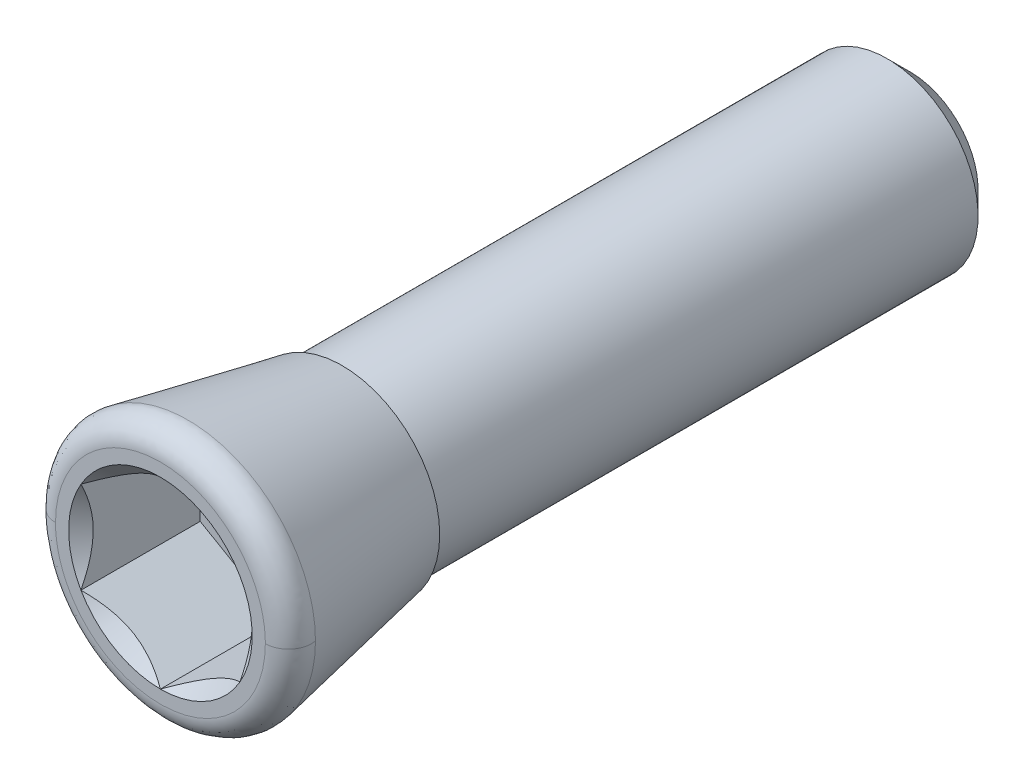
ISO-10303-21;
HEADER;
FILE_DESCRIPTION(('STEP AP214'),'2;1');
FILE_NAME('part.step','',(''),(''),'','','');
FILE_SCHEMA(('AUTOMOTIVE_DESIGN { 1 0 10303 214 1 1 1 1 }'));
ENDSEC;
DATA;
#1=APPLICATION_CONTEXT('core data for automotive mechanical design processes');
#2=APPLICATION_PROTOCOL_DEFINITION('international standard','automotive_design',2000,#1);
#3=PRODUCT_CONTEXT('',#1,'mechanical');
#4=PRODUCT('Part','Part','',(#3));
#5=PRODUCT_RELATED_PRODUCT_CATEGORY('part','',(#4));
#6=PRODUCT_DEFINITION_FORMATION('','',#4);
#7=PRODUCT_DEFINITION_CONTEXT('part definition',#1,'design');
#8=PRODUCT_DEFINITION('design','',#6,#7);
#9=PRODUCT_DEFINITION_SHAPE('','',#8);
#10=(LENGTH_UNIT() NAMED_UNIT(*) SI_UNIT(.MILLI.,.METRE.));
#11=(NAMED_UNIT(*) PLANE_ANGLE_UNIT() SI_UNIT($,.RADIAN.));
#12=(NAMED_UNIT(*) SI_UNIT($,.STERADIAN.) SOLID_ANGLE_UNIT());
#13=UNCERTAINTY_MEASURE_WITH_UNIT(LENGTH_MEASURE(1.E-05),#10,'distance_accuracy_value','');
#14=(GEOMETRIC_REPRESENTATION_CONTEXT(3) GLOBAL_UNCERTAINTY_ASSIGNED_CONTEXT((#13)) GLOBAL_UNIT_ASSIGNED_CONTEXT((#10,
#11,#12)) REPRESENTATION_CONTEXT('',''));
#15=CARTESIAN_POINT('',(0.,0.,0.));
#16=DIRECTION('',(0.,0.,1.));
#17=DIRECTION('',(1.,0.,0.));
#18=AXIS2_PLACEMENT_3D('',#15,#16,#17);
#19=CARTESIAN_POINT('',(-6.9999999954,-8.0829037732,-10.5000000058));
#20=DIRECTION('',(0.,0.,1.));
#21=DIRECTION('',(1.,0.,0.));
#22=AXIS2_PLACEMENT_3D('',#19,#20,#21);
#23=PLANE('',#22);
#24=DIRECTION('',(0.866025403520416,0.500000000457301,0.));
#25=VECTOR('',#24,1.);
#26=CARTESIAN_POINT('',(3.4999999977,-6.0621778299,-10.5000000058));
#27=LINE('',#26,#25);
#28=CARTESIAN_POINT('',(0.,-8.0829037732,-10.5000000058));
#29=VERTEX_POINT('',#28);
#30=CARTESIAN_POINT('',(6.9999999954,-4.0414518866,-10.5000000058));
#31=VERTEX_POINT('',#30);
#32=EDGE_CURVE('E105',#29,#31,#27,.T.);
#33=ORIENTED_EDGE('',*,*,#32,.T.);
#34=DIRECTION('',(0.,1.,0.));
#35=VECTOR('',#34,1.);
#36=CARTESIAN_POINT('',(6.9999999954,0.,-10.5000000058));
#37=LINE('',#36,#35);
#38=CARTESIAN_POINT('',(6.9999999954,4.0414518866,-10.5000000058));
#39=VERTEX_POINT('',#38);
#40=EDGE_CURVE('E106',#31,#39,#37,.T.);
#41=ORIENTED_EDGE('',*,*,#40,.T.);
#42=DIRECTION('',(-0.866025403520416,0.500000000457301,0.));
#43=VECTOR('',#42,1.);
#44=CARTESIAN_POINT('',(3.4999999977,6.0621778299,-10.5000000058));
#45=LINE('',#44,#43);
#46=CARTESIAN_POINT('',(0.,8.0829037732,-10.5000000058));
#47=VERTEX_POINT('',#46);
#48=EDGE_CURVE('E104',#39,#47,#45,.T.);
#49=ORIENTED_EDGE('',*,*,#48,.T.);
#50=DIRECTION('',(-0.866025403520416,-0.500000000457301,0.));
#51=VECTOR('',#50,1.);
#52=CARTESIAN_POINT('',(-3.4999999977,6.0621778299,-10.5000000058));
#53=LINE('',#52,#51);
#54=CARTESIAN_POINT('',(-6.9999999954,4.0414518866,-10.5000000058));
#55=VERTEX_POINT('',#54);
#56=EDGE_CURVE('E255',#47,#55,#53,.T.);
#57=ORIENTED_EDGE('',*,*,#56,.T.);
#58=DIRECTION('',(0.,-1.,0.));
#59=VECTOR('',#58,1.);
#60=CARTESIAN_POINT('',(-6.9999999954,0.,-10.5000000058));
#61=LINE('',#60,#59);
#62=CARTESIAN_POINT('',(-6.9999999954,-4.0414518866,-10.5000000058));
#63=VERTEX_POINT('',#62);
#64=EDGE_CURVE('E260',#55,#63,#61,.T.);
#65=ORIENTED_EDGE('',*,*,#64,.T.);
#66=DIRECTION('',(0.866025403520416,-0.500000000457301,0.));
#67=VECTOR('',#66,1.);
#68=CARTESIAN_POINT('',(-3.4999999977,-6.0621778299,-10.5000000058));
#69=LINE('',#68,#67);
#70=EDGE_CURVE('E265',#63,#29,#69,.T.);
#71=ORIENTED_EDGE('',*,*,#70,.T.);
#72=EDGE_LOOP('',(#33,#41,#49,#57,#65,#71));
#73=FACE_BOUND('',#72,.T.);
#74=ADVANCED_FACE('F14',(#73),#23,.T.);
#75=CARTESIAN_POINT('',(0.,8.0829037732,0.0630000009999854));
#76=DIRECTION('',(0.500000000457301,0.866025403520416,0.));
#77=DIRECTION('',(0.866025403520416,-0.500000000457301,0.));
#78=AXIS2_PLACEMENT_3D('',#75,#76,#77);
#79=PLANE('',#78);
#80=CARTESIAN_POINT('',(-1.90424028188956E-10,8.08290377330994,1.09898201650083E-10));
#81=CARTESIAN_POINT('',(0.120353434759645,8.01341768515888,-0.0694756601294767));
#82=CARTESIAN_POINT('',(0.24163193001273,7.94339751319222,-0.136819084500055));
#83=CARTESIAN_POINT('',(0.486220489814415,7.80218424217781,-0.26659289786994));
#84=CARTESIAN_POINT('',(0.609531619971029,7.73099052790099,-0.329020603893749));
#85=CARTESIAN_POINT('',(0.983931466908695,7.51483067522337,-0.508489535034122));
#86=CARTESIAN_POINT('',(1.23818945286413,7.36803475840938,-0.616951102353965));
#87=CARTESIAN_POINT('',(1.75092084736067,7.07200914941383,-0.802683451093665));
#88=CARTESIAN_POINT('',(2.00926323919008,6.92285509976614,-0.880422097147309));
#89=CARTESIAN_POINT('',(2.40102354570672,6.69667218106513,-0.970346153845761));
#90=CARTESIAN_POINT('',(2.53218703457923,6.62094490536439,-0.995861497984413));
#91=CARTESIAN_POINT('',(2.7956244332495,6.46884925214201,-1.03742022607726));
#92=CARTESIAN_POINT('',(2.92789817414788,6.39248097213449,-1.05346502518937));
#93=CARTESIAN_POINT('',(3.25024256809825,6.20637534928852,-1.08036714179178));
#94=CARTESIAN_POINT('',(3.44066055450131,6.09643747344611,-1.08601091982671));
#95=CARTESIAN_POINT('',(3.82115320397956,5.87675993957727,-1.07653288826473));
#96=CARTESIAN_POINT('',(4.01122772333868,5.76702036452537,-1.06140380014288));
#97=CARTESIAN_POINT('',(4.38958463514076,5.5485758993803,-1.01127183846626));
#98=CARTESIAN_POINT('',(4.57786478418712,5.43987230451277,-0.976246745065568));
#99=CARTESIAN_POINT('',(4.95118895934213,5.22433349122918,-0.888226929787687));
#100=CARTESIAN_POINT('',(5.13623323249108,5.11749813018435,-0.835233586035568));
#101=CARTESIAN_POINT('',(5.4646974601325,4.92785921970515,-0.726217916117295));
#102=CARTESIAN_POINT('',(5.60884517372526,4.84463549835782,-0.673064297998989));
#103=CARTESIAN_POINT('',(5.8945533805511,4.67968178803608,-0.558192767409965));
#104=CARTESIAN_POINT('',(6.03611379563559,4.59795184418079,-0.496474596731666));
#105=CARTESIAN_POINT('',(6.31620149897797,4.43624313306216,-0.365857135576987));
#106=CARTESIAN_POINT('',(6.45473675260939,4.35625976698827,-0.296980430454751));
#107=CARTESIAN_POINT('',(6.72924239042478,4.19777386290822,-0.152949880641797));
#108=CARTESIAN_POINT('',(6.86521428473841,4.11927045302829,-0.0777998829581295));
#109=CARTESIAN_POINT('',(7.00000000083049,4.0414518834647,-4.25741386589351E-09));
#110=B_SPLINE_CURVE_WITH_KNOTS('',3,(#80,#81,#82,#83,#84,#85,#86,#87,#88,#89,#90,#91,#92,#93,
#94,#95,#96,#97,#98,#99,#100,#101,#102,#103,#104,#105,#106,#107,#108,#109),.UNSPECIFIED.,.F.,
.F.,(4,2,2,2,2,2,2,2,2,2,2,2,2,2,4),(0.,0.46608558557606,0.93242382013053,1.87013398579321,
2.79295648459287,3.25346289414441,3.71390047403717,4.37271974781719,5.03176992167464,
5.69155757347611,6.35129463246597,6.87523436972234,7.39918990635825,7.92153983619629,
8.44357176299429),.UNSPECIFIED.);
#111=CARTESIAN_POINT('',(-8.28914245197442E-10,8.0829037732,0.));
#112=VERTEX_POINT('',#111);
#113=CARTESIAN_POINT('',(6.99999999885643,4.04145188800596,-3.69630714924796E-09));
#114=VERTEX_POINT('',#113);
#115=EDGE_CURVE('E75',#112,#114,#110,.T.);
#116=ORIENTED_EDGE('',*,*,#115,.F.);
#117=DIRECTION('',(0.,0.,-1.));
#118=VECTOR('',#117,1.);
#119=CARTESIAN_POINT('',(0.,8.0829037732,-5.21850000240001));
#120=LINE('',#119,#118);
#121=EDGE_CURVE('E112',#112,#47,#120,.T.);
#122=ORIENTED_EDGE('',*,*,#121,.T.);
#123=ORIENTED_EDGE('',*,*,#48,.F.);
#124=DIRECTION('',(0.,0.,1.));
#125=VECTOR('',#124,1.);
#126=CARTESIAN_POINT('',(6.9999999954,4.0414518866,-5.21850000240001));
#127=LINE('',#126,#125);
#128=EDGE_CURVE('E85',#39,#114,#127,.T.);
#129=ORIENTED_EDGE('',*,*,#128,.T.);
#130=EDGE_LOOP('',(#116,#122,#123,#129));
#131=FACE_BOUND('',#130,.T.);
#132=ADVANCED_FACE('F103',(#131),#79,.F.);
#133=CARTESIAN_POINT('',(6.9999999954,-4.0414518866,0.0630000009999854));
#134=DIRECTION('',(1.,0.,0.));
#135=DIRECTION('',(0.,0.,-1.));
#136=AXIS2_PLACEMENT_3D('',#133,#134,#135);
#137=PLANE('',#136);
#138=CARTESIAN_POINT('',(6.99999999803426,4.04145189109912,-6.5872168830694E-09));
#139=CARTESIAN_POINT('',(6.99999999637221,3.90338806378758,-0.0690220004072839));
#140=CARTESIAN_POINT('',(6.9999999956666,3.76426930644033,-0.135939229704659));
#141=CARTESIAN_POINT('',(6.99999999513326,3.48371687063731,-0.264929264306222));
#142=CARTESIAN_POINT('',(6.99999999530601,3.34228198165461,-0.326999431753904));
#143=CARTESIAN_POINT('',(6.99999999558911,2.91271256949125,-0.505587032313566));
#144=CARTESIAN_POINT('',(6.99999999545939,2.62096454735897,-0.613637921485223));
#145=CARTESIAN_POINT('',(6.99999999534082,2.02896997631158,-0.800156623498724));
#146=CARTESIAN_POINT('',(6.99999999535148,1.7287559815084,-0.878724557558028));
#147=CARTESIAN_POINT('',(6.9999999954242,1.27353845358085,-0.969551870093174));
#148=CARTESIAN_POINT('',(6.99999999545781,1.12117437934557,-0.995308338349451));
#149=CARTESIAN_POINT('',(6.99999999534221,0.815150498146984,-1.03722804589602));
#150=CARTESIAN_POINT('',(6.99999999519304,0.66149113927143,-1.05339447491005));
#151=CARTESIAN_POINT('',(6.9999999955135,0.423025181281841,-1.07064017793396));
#152=CARTESIAN_POINT('',(6.99999999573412,0.338459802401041,-1.07523577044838));
#153=CARTESIAN_POINT('',(6.99999999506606,0.16926674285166,-1.0813681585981));
#154=CARTESIAN_POINT('',(6.99999999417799,0.0846391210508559,-1.08290661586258));
#155=CARTESIAN_POINT('',(6.99999999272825,-0.212427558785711,-1.08289665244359));
#156=CARTESIAN_POINT('',(6.99999999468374,-0.424927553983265,-1.07318072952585));
#157=CARTESIAN_POINT('',(6.99999999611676,-0.848297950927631,-1.03484950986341));
#158=CARTESIAN_POINT('',(6.99999999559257,-1.05916711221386,-1.00622103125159));
#159=CARTESIAN_POINT('',(6.99999999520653,-1.47874358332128,-0.931410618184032));
#160=CARTESIAN_POINT('',(6.99999999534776,-1.68743634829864,-0.885147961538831));
#161=CARTESIAN_POINT('',(6.99999999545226,-2.10080931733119,-0.777183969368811));
#162=CARTESIAN_POINT('',(6.99999999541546,-2.30548794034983,-0.715476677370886));
#163=CARTESIAN_POINT('',(6.99999999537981,-2.77223551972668,-0.55805548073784));
#164=CARTESIAN_POINT('',(6.99999999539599,-3.03274032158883,-0.457711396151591));
#165=CARTESIAN_POINT('',(6.99999999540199,-3.41656486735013,-0.294472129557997));
#166=CARTESIAN_POINT('',(6.999999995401,-3.54279404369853,-0.238221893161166));
#167=CARTESIAN_POINT('',(6.999999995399,-3.79344553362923,-0.12187747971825));
#168=CARTESIAN_POINT('',(6.99999999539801,-3.91786814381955,-0.0617839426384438));
#169=CARTESIAN_POINT('',(6.9999999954,-4.04145188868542,-6.34990671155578E-09));
#170=B_SPLINE_CURVE_WITH_KNOTS('',3,(#138,#139,#140,#141,#142,#143,#144,#145,#146,#147,#148,
#149,#150,#151,#152,#153,#154,#155,#156,#157,#158,#159,#160,#161,#162,#163,#164,#165,#166,#167,
#168,#169),.UNSPECIFIED.,.F.,.F.,(4,2,2,2,2,2,2,2,2,2,2,2,2,2,2,4),(0.,0.463041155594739,
0.92633257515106,1.85846441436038,2.78740154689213,3.25072702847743,3.71389831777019,
3.9679183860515,4.22180035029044,4.85899417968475,5.49663259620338,6.13722561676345,
6.77806607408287,7.61462829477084,8.02916696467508,8.44363678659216),.UNSPECIFIED.);
#171=CARTESIAN_POINT('',(7.00000000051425,-4.0414518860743,-3.22640525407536E-09));
#172=VERTEX_POINT('',#171);
#173=EDGE_CURVE('E81',#114,#172,#170,.T.);
#174=ORIENTED_EDGE('',*,*,#173,.F.);
#175=ORIENTED_EDGE('',*,*,#128,.F.);
#176=ORIENTED_EDGE('',*,*,#40,.F.);
#177=DIRECTION('',(0.,0.,1.));
#178=VECTOR('',#177,1.);
#179=CARTESIAN_POINT('',(6.9999999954,-4.0414518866,-5.21850000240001));
#180=LINE('',#179,#178);
#181=EDGE_CURVE('E87',#31,#172,#180,.T.);
#182=ORIENTED_EDGE('',*,*,#181,.T.);
#183=EDGE_LOOP('',(#174,#175,#176,#182));
#184=FACE_BOUND('',#183,.T.);
#185=ADVANCED_FACE('F83',(#184),#137,.F.);
#186=CARTESIAN_POINT('',(6.9999999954,-4.0414518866,0.0630000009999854));
#187=DIRECTION('',(0.500000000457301,-0.866025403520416,0.));
#188=DIRECTION('',(-0.866025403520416,-0.500000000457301,0.));
#189=AXIS2_PLACEMENT_3D('',#186,#187,#188);
#190=PLANE('',#189);
#191=CARTESIAN_POINT('',(7.0000000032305,-4.04145188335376,-3.79550557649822E-09));
#192=CARTESIAN_POINT('',(6.87964656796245,-4.11093797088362,-0.0694756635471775));
#193=CARTESIAN_POINT('',(6.75836807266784,-4.18095814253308,-0.136819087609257));
#194=CARTESIAN_POINT('',(6.51377951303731,-4.32217141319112,-0.266592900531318));
#195=CARTESIAN_POINT('',(6.39046838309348,-4.39336512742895,-0.329020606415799));
#196=CARTESIAN_POINT('',(6.01606853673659,-4.60952497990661,-0.508489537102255));
#197=CARTESIAN_POINT('',(5.76181055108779,-4.75632089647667,-0.61695110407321));
#198=CARTESIAN_POINT('',(5.24907915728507,-5.052346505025,-0.802683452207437));
#199=CARTESIAN_POINT('',(4.99073676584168,-5.20150055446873,-0.880422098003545));
#200=CARTESIAN_POINT('',(4.59897645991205,-5.42768347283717,-0.970346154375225));
#201=CARTESIAN_POINT('',(4.46781297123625,-5.5034107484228,-0.995861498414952));
#202=CARTESIAN_POINT('',(4.20437557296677,-5.65550640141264,-1.03742022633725));
#203=CARTESIAN_POINT('',(4.07210183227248,-5.73187468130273,-1.05346502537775));
#204=CARTESIAN_POINT('',(3.74975743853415,-5.9179803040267,-1.08036714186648));
#205=CARTESIAN_POINT('',(3.55933945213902,-6.02791817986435,-1.08601091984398));
#206=CARTESIAN_POINT('',(3.17884680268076,-6.24759571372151,-1.07653288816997));
#207=CARTESIAN_POINT('',(2.9887722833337,-6.35733528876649,-1.06140379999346));
#208=CARTESIAN_POINT('',(2.61041537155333,-6.57577975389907,-1.01127183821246));
#209=CARTESIAN_POINT('',(2.42213522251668,-6.68448334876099,-0.976246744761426));
#210=CARTESIAN_POINT('',(2.04881104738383,-6.90002216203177,-0.88822692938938));
#211=CARTESIAN_POINT('',(1.86376677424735,-7.00685752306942,-0.835233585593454));
#212=CARTESIAN_POINT('',(1.53530254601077,-7.19649643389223,-0.726217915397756));
#213=CARTESIAN_POINT('',(1.39115483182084,-7.27972015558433,-0.673064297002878));
#214=CARTESIAN_POINT('',(1.1054466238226,-7.44467386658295,-0.558192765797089));
#215=CARTESIAN_POINT('',(0.963886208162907,-7.52640381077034,-0.496474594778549));
#216=CARTESIAN_POINT('',(0.683798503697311,-7.68811252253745,-0.36585713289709));
#217=CARTESIAN_POINT('',(0.545263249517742,-7.76809588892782,-0.296980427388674));
#218=CARTESIAN_POINT('',(0.270757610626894,-7.92658179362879,-0.152949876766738));
#219=CARTESIAN_POINT('',(0.13478571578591,-8.00508520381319,-0.0777998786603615));
#220=CARTESIAN_POINT('',(-8.25208548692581E-10,-8.08290377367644,4.76396699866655E-10));
#221=B_SPLINE_CURVE_WITH_KNOTS('',3,(#191,#192,#193,#194,#195,#196,#197,#198,#199,#200,#201,
#202,#203,#204,#205,#206,#207,#208,#209,#210,#211,#212,#213,#214,#215,#216,#217,#218,#219,#220),
.UNSPECIFIED.,.F.,.F.,(4,2,2,2,2,2,2,2,2,2,2,2,2,2,4),(0.,0.466085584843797,0.932423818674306,
1.87013398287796,2.79295648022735,3.25346288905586,3.71390046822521,4.37271974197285,
5.0317699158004,5.691557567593,6.35129462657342,6.87523436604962,7.39918990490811,
7.92153983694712,8.44357176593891),.UNSPECIFIED.);
#222=CARTESIAN_POINT('',(-1.55470505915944E-09,-8.0829037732,0.));
#223=VERTEX_POINT('',#222);
#224=EDGE_CURVE('E91',#172,#223,#221,.T.);
#225=ORIENTED_EDGE('',*,*,#224,.F.);
#226=ORIENTED_EDGE('',*,*,#181,.F.);
#227=ORIENTED_EDGE('',*,*,#32,.F.);
#228=DIRECTION('',(0.,0.,1.));
#229=VECTOR('',#228,1.);
#230=CARTESIAN_POINT('',(0.,-8.0829037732,-5.21850000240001));
#231=LINE('',#230,#229);
#232=EDGE_CURVE('E263',#29,#223,#231,.T.);
#233=ORIENTED_EDGE('',*,*,#232,.T.);
#234=EDGE_LOOP('',(#225,#226,#227,#233));
#235=FACE_BOUND('',#234,.T.);
#236=ADVANCED_FACE('F182',(#235),#190,.F.);
#237=CARTESIAN_POINT('',(0.,-8.0829037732,0.0630000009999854));
#238=DIRECTION('',(-0.500000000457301,-0.866025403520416,0.));
#239=DIRECTION('',(-0.866025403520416,0.500000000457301,0.));
#240=AXIS2_PLACEMENT_3D('',#237,#238,#239);
#241=PLANE('',#240);
#242=CARTESIAN_POINT('',(-8.59793667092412E-10,-8.0829037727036,-4.96408469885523E-10));
#243=CARTESIAN_POINT('',(-0.120353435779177,-8.01341768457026,-0.0694756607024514));
#244=CARTESIAN_POINT('',(-0.241631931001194,-7.94339751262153,-0.136819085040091));
#245=CARTESIAN_POINT('',(-0.486220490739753,-7.80218424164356,-0.266592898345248));
#246=CARTESIAN_POINT('',(-0.609531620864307,-7.73099052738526,-0.32902060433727));
#247=CARTESIAN_POINT('',(-0.983931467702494,-7.51483067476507,-0.508489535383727));
#248=CARTESIAN_POINT('',(-1.23818945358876,-7.36803475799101,-0.616951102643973));
#249=CARTESIAN_POINT('',(-1.75092084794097,-7.0720091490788,-0.802683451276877));
#250=CARTESIAN_POINT('',(-2.00926323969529,-6.92285509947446,-0.880422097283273));
#251=CARTESIAN_POINT('',(-2.40102354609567,-6.69667218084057,-0.970346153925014));
#252=CARTESIAN_POINT('',(-2.532187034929,-6.62094490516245,-0.995861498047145));
#253=CARTESIAN_POINT('',(-2.79562443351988,-6.46884925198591,-1.03742022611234));
#254=CARTESIAN_POINT('',(-2.92789817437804,-6.3924809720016,-1.05346502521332));
#255=CARTESIAN_POINT('',(-3.25024256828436,-6.20637534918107,-1.08036714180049));
#256=CARTESIAN_POINT('',(-3.44066055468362,-6.09643747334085,-1.08601091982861));
#257=CARTESIAN_POINT('',(-3.82115320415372,-5.87675993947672,-1.07653288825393));
#258=CARTESIAN_POINT('',(-4.01122772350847,-5.76702036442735,-1.0614038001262));
#259=CARTESIAN_POINT('',(-4.38958463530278,-5.54857589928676,-1.01127183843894));
#260=CARTESIAN_POINT('',(-4.57786478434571,-5.4398723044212,-0.976246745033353));
#261=CARTESIAN_POINT('',(-4.9511889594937,-5.22433349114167,-0.88822692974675));
#262=CARTESIAN_POINT('',(-5.13623323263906,-5.11749813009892,-0.835233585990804));
#263=CARTESIAN_POINT('',(-5.46469746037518,-4.92785921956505,-0.726217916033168));
#264=CARTESIAN_POINT('',(-5.6088451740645,-4.84463549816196,-0.673064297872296));
#265=CARTESIAN_POINT('',(-5.89455338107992,-4.67968178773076,-0.558192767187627));
#266=CARTESIAN_POINT('',(-6.03611379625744,-4.59795184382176,-0.496474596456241));
#267=CARTESIAN_POINT('',(-6.31620149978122,-4.43624313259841,-0.365857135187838));
#268=CARTESIAN_POINT('',(-6.45473675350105,-4.35625976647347,-0.296980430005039));
#269=CARTESIAN_POINT('',(-6.72924239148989,-4.19777386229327,-0.152949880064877));
#270=CARTESIAN_POINT('',(-6.86521428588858,-4.11927045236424,-0.0777998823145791));
#271=CARTESIAN_POINT('',(-7.00000000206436,-4.04145188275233,-3.54499762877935E-09));
#272=B_SPLINE_CURVE_WITH_KNOTS('',3,(#242,#243,#244,#245,#246,#247,#248,#249,#250,#251,#252,
#253,#254,#255,#256,#257,#258,#259,#260,#261,#262,#263,#264,#265,#266,#267,#268,#269,#270,#271),
.UNSPECIFIED.,.F.,.F.,(4,2,2,2,2,2,2,2,2,2,2,2,2,2,4),(0.,0.466085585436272,0.932423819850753,
1.87013398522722,2.79295648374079,3.25346289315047,3.71390047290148,4.37271974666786,
5.03176992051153,5.69155757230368,6.35129463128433,6.87523436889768,7.39918990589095,
7.92153983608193,8.44357176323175),.UNSPECIFIED.);
#273=CARTESIAN_POINT('',(-7.00000000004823,-4.04145188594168,-3.69630714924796E-09));
#274=VERTEX_POINT('',#273);
#275=EDGE_CURVE('E165',#223,#274,#272,.T.);
#276=ORIENTED_EDGE('',*,*,#275,.F.);
#277=ORIENTED_EDGE('',*,*,#232,.F.);
#278=ORIENTED_EDGE('',*,*,#70,.F.);
#279=DIRECTION('',(0.,0.,1.));
#280=VECTOR('',#279,1.);
#281=CARTESIAN_POINT('',(-6.9999999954,-4.0414518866,-5.21850000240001));
#282=LINE('',#281,#280);
#283=EDGE_CURVE('E258',#63,#274,#282,.T.);
#284=ORIENTED_EDGE('',*,*,#283,.T.);
#285=EDGE_LOOP('',(#276,#277,#278,#284));
#286=FACE_BOUND('',#285,.T.);
#287=ADVANCED_FACE('F178',(#286),#241,.F.);
#288=CARTESIAN_POINT('',(-6.9999999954,-4.0414518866,-10.5000000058));
#289=DIRECTION('',(-1.,0.,0.));
#290=DIRECTION('',(0.,0.,1.));
#291=AXIS2_PLACEMENT_3D('',#288,#289,#290);
#292=PLANE('',#291);
#293=CARTESIAN_POINT('',(-6.99999999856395,-4.04145188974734,-7.55341622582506E-09));
#294=CARTESIAN_POINT('',(-6.9999999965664,-3.90247971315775,-0.0694756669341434));
#295=CARTESIAN_POINT('',(-6.99999999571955,-3.76243936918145,-0.136819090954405));
#296=CARTESIAN_POINT('',(-6.99999999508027,-3.48001282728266,-0.266592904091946));
#297=CARTESIAN_POINT('',(-6.99999999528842,-3.33762539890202,-0.329020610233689));
#298=CARTESIAN_POINT('',(-6.99999999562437,-2.90530569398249,-0.508489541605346));
#299=CARTESIAN_POINT('',(-6.99999999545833,-2.61171386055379,-0.616951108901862));
#300=CARTESIAN_POINT('',(-6.99999999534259,-2.01966264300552,-0.802683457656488));
#301=CARTESIAN_POINT('',(-6.99999999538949,-1.72135454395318,-0.880422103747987));
#302=CARTESIAN_POINT('',(-6.99999999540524,-1.26898870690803,-0.970346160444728));
#303=CARTESIAN_POINT('',(-6.99999999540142,-1.1175341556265,-0.995861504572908));
#304=CARTESIAN_POINT('',(-6.99999999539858,-0.813342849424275,-1.03742023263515));
#305=CARTESIAN_POINT('',(-6.99999999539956,-0.660606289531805,-1.05346503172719));
#306=CARTESIAN_POINT('',(-6.99999999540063,-0.288395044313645,-1.08036714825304));
#307=CARTESIAN_POINT('',(-6.99999999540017,-0.068519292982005,-1.08601092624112));
#308=CARTESIAN_POINT('',(-6.99999999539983,0.370835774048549,-1.07653289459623));
#309=CARTESIAN_POINT('',(-6.99999999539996,0.590314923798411,-1.06140380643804));
#310=CARTESIAN_POINT('',(-6.99999999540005,1.02720385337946,-1.01127184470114));
#311=CARTESIAN_POINT('',(-6.99999999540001,1.24461104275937,-0.976246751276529));
#312=CARTESIAN_POINT('',(-6.99999999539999,1.6756886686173,-0.888226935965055));
#313=CARTESIAN_POINT('',(-6.9999999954,1.88935939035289,-0.835233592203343));
#314=CARTESIAN_POINT('',(-6.9999999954,2.2686372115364,-0.726217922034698));
#315=CARTESIAN_POINT('',(-6.9999999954,2.43508465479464,-0.673064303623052));
#316=CARTESIAN_POINT('',(-6.9999999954,2.76499207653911,-0.55819277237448));
#317=CARTESIAN_POINT('',(-6.9999999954,2.92845196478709,-0.496474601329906));
#318=CARTESIAN_POINT('',(-6.9999999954,3.2518693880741,-0.365857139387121));
#319=CARTESIAN_POINT('',(-6.9999999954,3.41183612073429,-0.29698043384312));
#320=CARTESIAN_POINT('',(-6.9999999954,3.72880792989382,-0.152949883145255));
#321=CARTESIAN_POINT('',(-6.9999999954,3.88581475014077,-0.0777998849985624));
#322=CARTESIAN_POINT('',(-6.9999999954,4.04145188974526,-5.82001113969E-09));
#323=B_SPLINE_CURVE_WITH_KNOTS('',3,(#293,#294,#295,#296,#297,#298,#299,#300,#301,#302,#303,
#304,#305,#306,#307,#308,#309,#310,#311,#312,#313,#314,#315,#316,#317,#318,#319,#320,#321,#322),
.UNSPECIFIED.,.F.,.F.,(4,2,2,2,2,2,2,2,2,2,2,2,2,2,4),(0.,0.466085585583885,0.93242382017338,
1.8701339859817,2.79295648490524,3.25346289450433,3.71390047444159,4.37271974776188,
5.03176992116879,5.69155757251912,6.35129463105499,6.87523437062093,7.39918990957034,
7.92153984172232,8.4435717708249),.UNSPECIFIED.);
#324=CARTESIAN_POINT('',(-6.99999999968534,4.04145188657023,-3.69630714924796E-09));
#325=VERTEX_POINT('',#324);
#326=EDGE_CURVE('E122',#274,#325,#323,.T.);
#327=ORIENTED_EDGE('',*,*,#326,.F.);
#328=ORIENTED_EDGE('',*,*,#283,.F.);
#329=ORIENTED_EDGE('',*,*,#64,.F.);
#330=DIRECTION('',(0.,0.,1.));
#331=VECTOR('',#330,1.);
#332=CARTESIAN_POINT('',(-6.9999999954,4.0414518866,-5.21850000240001));
#333=LINE('',#332,#331);
#334=EDGE_CURVE('E251',#55,#325,#333,.T.);
#335=ORIENTED_EDGE('',*,*,#334,.T.);
#336=EDGE_LOOP('',(#327,#328,#329,#335));
#337=FACE_BOUND('',#336,.T.);
#338=ADVANCED_FACE('F181',(#337),#292,.F.);
#339=CARTESIAN_POINT('',(-6.9999999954,4.0414518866,0.0630000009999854));
#340=DIRECTION('',(-0.500000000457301,0.866025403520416,0.));
#341=DIRECTION('',(0.866025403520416,0.500000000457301,0.));
#342=AXIS2_PLACEMENT_3D('',#339,#340,#341);
#343=PLANE('',#342);
#344=CARTESIAN_POINT('',(-7.00000000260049,4.04145188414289,-4.46760684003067E-09));
#345=CARTESIAN_POINT('',(-6.87964656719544,4.11093797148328,-0.0694756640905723));
#346=CARTESIAN_POINT('',(-6.75836807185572,4.18095814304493,-0.136819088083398));
#347=CARTESIAN_POINT('',(-6.51377951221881,4.3221714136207,-0.266592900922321));
#348=CARTESIAN_POINT('',(-6.39046838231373,4.39336512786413,-0.329020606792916));
#349=CARTESIAN_POINT('',(-6.01606853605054,4.60952498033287,-0.508489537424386));
#350=CARTESIAN_POINT('',(-5.76181055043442,4.75632089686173,-0.616951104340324));
#351=CARTESIAN_POINT('',(-5.24907915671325,5.05234650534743,-0.802683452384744));
#352=CARTESIAN_POINT('',(-4.99073676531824,5.20150055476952,-0.88042209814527));
#353=CARTESIAN_POINT('',(-4.59897645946,5.42768347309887,-0.970346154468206));
#354=CARTESIAN_POINT('',(-4.46781297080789,5.50341074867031,-0.99586149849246));
#355=CARTESIAN_POINT('',(-4.20437557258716,5.65550640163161,-1.03742022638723));
#356=CARTESIAN_POINT('',(-4.07210183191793,5.73187468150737,-1.05346502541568));
#357=CARTESIAN_POINT('',(-3.74975743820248,5.91798030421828,-1.08036714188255));
#358=CARTESIAN_POINT('',(-3.5593394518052,6.02791818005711,-1.08601091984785));
#359=CARTESIAN_POINT('',(-3.17884680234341,6.24759571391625,-1.07653288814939));
#360=CARTESIAN_POINT('',(-2.98877228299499,6.35733528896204,-1.06140379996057));
#361=CARTESIAN_POINT('',(-2.61041537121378,6.57577975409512,-1.01127183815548));
#362=CARTESIAN_POINT('',(-2.42213522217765,6.68448334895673,-0.976246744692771));
#363=CARTESIAN_POINT('',(-2.04881104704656,6.90002216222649,-0.888226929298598));
#364=CARTESIAN_POINT('',(-1.8637667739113,7.00685752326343,-0.835233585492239));
#365=CARTESIAN_POINT('',(-1.53530254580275,7.19649643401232,-0.72621791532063));
#366=CARTESIAN_POINT('',(-1.3911548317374,7.2797201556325,-0.673064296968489));
#367=CARTESIAN_POINT('',(-1.10544662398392,7.44467386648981,-0.558192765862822));
#368=CARTESIAN_POINT('',(-0.963886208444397,7.52640381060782,-0.496474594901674));
#369=CARTESIAN_POINT('',(-0.683798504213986,7.68811252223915,-0.365857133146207));
#370=CARTESIAN_POINT('',(-0.545263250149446,7.7680958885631,-0.296980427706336));
#371=CARTESIAN_POINT('',(-0.270757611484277,7.92658179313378,-0.152949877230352));
#372=CARTESIAN_POINT('',(-0.134785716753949,8.00508520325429,-0.0777998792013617));
#373=CARTESIAN_POINT('',(-2.51667073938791E-10,8.0829037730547,-1.45300438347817E-10));
#374=B_SPLINE_CURVE_WITH_KNOTS('',3,(#344,#345,#346,#347,#348,#349,#350,#351,#352,#353,#354,
#355,#356,#357,#358,#359,#360,#361,#362,#363,#364,#365,#366,#367,#368,#369,#370,#371,#372,#373),
.UNSPECIFIED.,.F.,.F.,(4,2,2,2,2,2,2,2,2,2,2,2,2,2,4),(0.,0.466085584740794,0.932423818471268,
1.8701339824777,2.79295647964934,3.25346288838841,3.71390046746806,4.37271974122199,
5.03176991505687,5.69155756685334,6.35129462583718,6.87523436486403,7.39918990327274,
7.92153983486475,8.44357176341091),.UNSPECIFIED.);
#375=EDGE_CURVE('E120',#325,#112,#374,.T.);
#376=ORIENTED_EDGE('',*,*,#375,.F.);
#377=ORIENTED_EDGE('',*,*,#334,.F.);
#378=ORIENTED_EDGE('',*,*,#56,.F.);
#379=ORIENTED_EDGE('',*,*,#121,.F.);
#380=EDGE_LOOP('',(#376,#377,#378,#379));
#381=FACE_BOUND('',#380,.T.);
#382=ADVANCED_FACE('F139',(#381),#343,.F.);
#383=CARTESIAN_POINT('',(0.,0.,-1.08994743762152));
#384=DIRECTION('',(0.,0.,1.));
#385=DIRECTION('',(0.,1.,0.));
#386=AXIS2_PLACEMENT_3D('',#383,#384,#385);
#387=CONICAL_SURFACE('',#386,6.99295633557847,0.785398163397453);
#388=CARTESIAN_POINT('',(0.,0.,0.));
#389=DIRECTION('',(0.,0.,1.));
#390=DIRECTION('',(0.,1.,0.));
#391=AXIS2_PLACEMENT_3D('',#388,#389,#390);
#392=CIRCLE('',#391,8.0829037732);
#393=EDGE_CURVE('E100',#112,#114,#392,.F.);
#394=ORIENTED_EDGE('',*,*,#393,.F.);
#395=ORIENTED_EDGE('',*,*,#115,.T.);
#396=EDGE_LOOP('',(#394,#395));
#397=FACE_BOUND('',#396,.T.);
#398=ADVANCED_FACE('F110',(#397),#387,.F.);
#399=CARTESIAN_POINT('',(0.,0.,-1.08940119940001));
#400=DIRECTION('',(0.,0.,1.));
#401=DIRECTION('',(1.,0.,0.));
#402=AXIS2_PLACEMENT_3D('',#399,#400,#401);
#403=CONICAL_SURFACE('',#402,6.9935025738,0.785398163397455);
#404=ORIENTED_EDGE('',*,*,#173,.T.);
#405=CARTESIAN_POINT('',(0.,0.,0.));
#406=DIRECTION('',(0.,0.,1.));
#407=DIRECTION('',(1.,0.,0.));
#408=AXIS2_PLACEMENT_3D('',#405,#406,#407);
#409=CIRCLE('',#408,8.0829037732);
#410=EDGE_CURVE('E94',#114,#172,#409,.F.);
#411=ORIENTED_EDGE('',*,*,#410,.F.);
#412=EDGE_LOOP('',(#404,#411));
#413=FACE_BOUND('',#412,.T.);
#414=ADVANCED_FACE('F95',(#413),#403,.F.);
#415=CARTESIAN_POINT('',(0.,0.,-1.08994743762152));
#416=DIRECTION('',(0.,0.,1.));
#417=DIRECTION('',(0.,1.,0.));
#418=AXIS2_PLACEMENT_3D('',#415,#416,#417);
#419=CONICAL_SURFACE('',#418,6.99295633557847,0.785398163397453);
#420=CARTESIAN_POINT('',(0.,0.,0.));
#421=DIRECTION('',(0.,0.,1.));
#422=DIRECTION('',(0.,1.,0.));
#423=AXIS2_PLACEMENT_3D('',#420,#421,#422);
#424=CIRCLE('',#423,8.0829037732);
#425=EDGE_CURVE('E99',#172,#223,#424,.F.);
#426=ORIENTED_EDGE('',*,*,#425,.F.);
#427=ORIENTED_EDGE('',*,*,#224,.T.);
#428=EDGE_LOOP('',(#426,#427));
#429=FACE_BOUND('',#428,.T.);
#430=ADVANCED_FACE('F161',(#429),#419,.F.);
#431=CARTESIAN_POINT('',(0.,0.,-1.08994743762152));
#432=DIRECTION('',(0.,0.,1.));
#433=DIRECTION('',(0.,1.,0.));
#434=AXIS2_PLACEMENT_3D('',#431,#432,#433);
#435=CONICAL_SURFACE('',#434,6.99295633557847,0.785398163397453);
#436=CARTESIAN_POINT('',(0.,0.,0.));
#437=DIRECTION('',(0.,0.,1.));
#438=DIRECTION('',(0.,1.,0.));
#439=AXIS2_PLACEMENT_3D('',#436,#437,#438);
#440=CIRCLE('',#439,8.0829037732);
#441=EDGE_CURVE('E322',#223,#274,#440,.F.);
#442=ORIENTED_EDGE('',*,*,#441,.F.);
#443=ORIENTED_EDGE('',*,*,#275,.T.);
#444=EDGE_LOOP('',(#442,#443));
#445=FACE_BOUND('',#444,.T.);
#446=ADVANCED_FACE('F156',(#445),#435,.F.);
#447=CARTESIAN_POINT('',(0.,0.,-1.08941791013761));
#448=DIRECTION('',(0.,0.,1.));
#449=DIRECTION('',(1.,0.,0.));
#450=AXIS2_PLACEMENT_3D('',#447,#448,#449);
#451=CONICAL_SURFACE('',#450,6.9934858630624,0.785398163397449);
#452=CARTESIAN_POINT('',(0.,0.,0.));
#453=DIRECTION('',(0.,0.,1.));
#454=DIRECTION('',(1.,0.,0.));
#455=AXIS2_PLACEMENT_3D('',#452,#453,#454);
#456=CIRCLE('',#455,8.0829037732);
#457=EDGE_CURVE('E320',#274,#325,#456,.F.);
#458=ORIENTED_EDGE('',*,*,#457,.F.);
#459=ORIENTED_EDGE('',*,*,#326,.T.);
#460=EDGE_LOOP('',(#458,#459));
#461=FACE_BOUND('',#460,.T.);
#462=ADVANCED_FACE('F146',(#461),#451,.F.);
#463=CARTESIAN_POINT('',(0.,0.,-1.08994743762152));
#464=DIRECTION('',(0.,0.,1.));
#465=DIRECTION('',(0.,1.,0.));
#466=AXIS2_PLACEMENT_3D('',#463,#464,#465);
#467=CONICAL_SURFACE('',#466,6.99295633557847,0.785398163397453);
#468=CARTESIAN_POINT('',(0.,0.,0.));
#469=DIRECTION('',(0.,0.,1.));
#470=DIRECTION('',(0.,1.,0.));
#471=AXIS2_PLACEMENT_3D('',#468,#469,#470);
#472=CIRCLE('',#471,8.0829037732);
#473=EDGE_CURVE('E119',#325,#112,#472,.F.);
#474=ORIENTED_EDGE('',*,*,#473,.F.);
#475=ORIENTED_EDGE('',*,*,#375,.T.);
#476=EDGE_LOOP('',(#474,#475));
#477=FACE_BOUND('',#476,.T.);
#478=ADVANCED_FACE('F142',(#477),#467,.F.);
#479=CARTESIAN_POINT('',(-9.350121,-9.350121,0.));
#480=DIRECTION('',(0.,0.,1.));
#481=DIRECTION('',(1.,0.,0.));
#482=AXIS2_PLACEMENT_3D('',#479,#480,#481);
#483=PLANE('',#482);
#484=ORIENTED_EDGE('',*,*,#457,.T.);
#485=ORIENTED_EDGE('',*,*,#473,.T.);
#486=ORIENTED_EDGE('',*,*,#393,.T.);
#487=ORIENTED_EDGE('',*,*,#410,.T.);
#488=ORIENTED_EDGE('',*,*,#425,.T.);
#489=ORIENTED_EDGE('',*,*,#441,.T.);
#490=EDGE_LOOP('',(#484,#485,#486,#487,#488,#489));
#491=FACE_BOUND('',#490,.T.);
#492=CARTESIAN_POINT('',(-9.23925001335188,0.,-4.32480888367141E-09));
#493=CARTESIAN_POINT('',(-9.23925001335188,18.4785000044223,-4.32474013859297E-09));
#494=CARTESIAN_POINT('',(9.23925001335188,18.4785000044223,-4.32474013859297E-09));
#495=CARTESIAN_POINT('',(9.23925001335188,0.,-4.32480888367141E-09));
#496=(BOUNDED_CURVE() B_SPLINE_CURVE(3,(#492,#493,#494,#495),.UNSPECIFIED.,.F.,
.F.) B_SPLINE_CURVE_WITH_KNOTS((4,4),(0.,1.),
.UNSPECIFIED.) CURVE() GEOMETRIC_REPRESENTATION_ITEM() RATIONAL_B_SPLINE_CURVE((0.950973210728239,
0.316991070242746,0.316991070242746,0.950973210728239)) REPRESENTATION_ITEM(''));
#497=CARTESIAN_POINT('',(-9.23925000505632,0.,-2.59489651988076E-09));
#498=VERTEX_POINT('',#497);
#499=CARTESIAN_POINT('',(9.23925000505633,0.,-2.59489651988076E-09));
#500=VERTEX_POINT('',#499);
#501=EDGE_CURVE('E240',#498,#500,#496,.T.);
#502=ORIENTED_EDGE('',*,*,#501,.F.);
#503=CARTESIAN_POINT('',(9.23925001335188,0.,-4.32480888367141E-09));
#504=CARTESIAN_POINT('',(9.23925001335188,-18.4785000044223,-4.32474013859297E-09));
#505=CARTESIAN_POINT('',(-9.23925001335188,-18.4785000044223,-4.32474013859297E-09));
#506=CARTESIAN_POINT('',(-9.23925001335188,0.,-4.32480888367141E-09));
#507=(BOUNDED_CURVE() B_SPLINE_CURVE(3,(#503,#504,#505,#506),.UNSPECIFIED.,.F.,
.F.) B_SPLINE_CURVE_WITH_KNOTS((4,4),(0.,1.),
.UNSPECIFIED.) CURVE() GEOMETRIC_REPRESENTATION_ITEM() RATIONAL_B_SPLINE_CURVE((0.950973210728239,
0.316991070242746,0.316991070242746,0.950973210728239)) REPRESENTATION_ITEM(''));
#508=EDGE_CURVE('E502',#500,#498,#507,.T.);
#509=ORIENTED_EDGE('',*,*,#508,.F.);
#510=EDGE_LOOP('',(#502,#509));
#511=FACE_BOUND('',#510,.T.);
#512=ADVANCED_FACE('F116',(#491,#511),#483,.T.);
#513=CARTESIAN_POINT('',(-11.1852436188,0.,-2.61692123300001));
#514=CARTESIAN_POINT('',(-11.1852436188,22.3704872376,-2.61692123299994));
#515=CARTESIAN_POINT('',(11.1852436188,22.3704872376,-2.61692123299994));
#516=CARTESIAN_POINT('',(11.1852436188,0.,-2.61692123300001));
#517=CARTESIAN_POINT('',(-11.6457453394,0.,-1.08486295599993));
#518=CARTESIAN_POINT('',(-11.6457453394,23.2914906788,-1.08486295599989));
#519=CARTESIAN_POINT('',(11.6457453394,23.2914906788,-1.08486295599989));
#520=CARTESIAN_POINT('',(11.6457453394,0.,-1.08486295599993));
#521=CARTESIAN_POINT('',(-10.6281664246,0.,0.149558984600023));
#522=CARTESIAN_POINT('',(-10.6281664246,21.2563328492,0.149558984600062));
#523=CARTESIAN_POINT('',(10.6281664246,21.2563328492,0.149558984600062));
#524=CARTESIAN_POINT('',(10.6281664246,0.,0.149558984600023));
#525=CARTESIAN_POINT('',(-9.0363885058,0.,-0.0101515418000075));
#526=CARTESIAN_POINT('',(-9.0363885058,18.0727769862,-0.0101515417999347));
#527=CARTESIAN_POINT('',(9.0363885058,18.0727769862,-0.0101515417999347));
#528=CARTESIAN_POINT('',(9.0363885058,0.,-0.0101515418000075));
#529=(BOUNDED_SURFACE() B_SPLINE_SURFACE(3,3,((#513,#514,#515,#516),(#517,#518,#519,#520),(#521,
#522,#523,#524),(#525,#526,#527,#528)),.UNSPECIFIED.,.F.,.F.,
.F.) B_SPLINE_SURFACE_WITH_KNOTS((4,4),(4,4),(0.,1.),(0.,1.),
.UNSPECIFIED.) GEOMETRIC_REPRESENTATION_ITEM() RATIONAL_B_SPLINE_SURFACE(((1.,0.333333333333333,
0.333333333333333,1.),(0.703911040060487,0.234637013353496,0.234637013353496,0.703911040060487),
(0.703911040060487,0.234637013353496,0.234637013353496,0.703911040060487),(1.,0.333333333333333,
0.333333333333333,1.))) REPRESENTATION_ITEM('') SURFACE());
#530=CARTESIAN_POINT('',(0.,0.,-2.419723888));
#531=DIRECTION('',(0.,0.,1.));
#532=DIRECTION('',(1.,0.,0.));
#533=AXIS2_PLACEMENT_3D('',#530,#531,#532);
#534=CIRCLE('',#533,11.233916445);
#535=CARTESIAN_POINT('',(11.2339164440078,-1.00873411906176E-09,-2.41972388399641));
#536=VERTEX_POINT('',#535);
#537=CARTESIAN_POINT('',(-11.2339164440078,-3.45617216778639E-09,-2.41972388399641));
#538=VERTEX_POINT('',#537);
#539=EDGE_CURVE('E496',#536,#538,#534,.T.);
#540=CARTESIAN_POINT('',(-11.1852436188,0.,-2.61692123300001));
#541=CARTESIAN_POINT('',(-11.6457453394,0.,-1.08486295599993));
#542=CARTESIAN_POINT('',(-10.6281664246,0.,0.149558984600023));
#543=CARTESIAN_POINT('',(-9.0363885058,0.,-0.0101515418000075));
#544=(BOUNDED_CURVE() B_SPLINE_CURVE(3,(#540,#541,#542,#543),.UNSPECIFIED.,.F.,
.F.) B_SPLINE_CURVE_WITH_KNOTS((4,4),(0.,1.),
.UNSPECIFIED.) CURVE() GEOMETRIC_REPRESENTATION_ITEM() RATIONAL_B_SPLINE_CURVE((1.,
0.703911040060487,0.703911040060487,1.)) REPRESENTATION_ITEM(''));
#545=EDGE_CURVE('E498',#498,#538,#544,.F.);
#546=CARTESIAN_POINT('',(11.1852436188,0.,-2.61692123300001));
#547=CARTESIAN_POINT('',(11.6457453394,0.,-1.08486295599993));
#548=CARTESIAN_POINT('',(10.6281664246,0.,0.149558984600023));
#549=CARTESIAN_POINT('',(9.0363885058,0.,-0.0101515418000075));
#550=(BOUNDED_CURVE() B_SPLINE_CURVE(3,(#546,#547,#548,#549),.UNSPECIFIED.,.F.,
.F.) B_SPLINE_CURVE_WITH_KNOTS((4,4),(0.,1.),
.UNSPECIFIED.) CURVE() GEOMETRIC_REPRESENTATION_ITEM() RATIONAL_B_SPLINE_CURVE((1.,
0.703911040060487,0.703911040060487,1.)) REPRESENTATION_ITEM(''));
#551=EDGE_CURVE('E31',#536,#500,#550,.T.);
#552=ORIENTED_EDGE('',*,*,#539,.T.);
#553=ORIENTED_EDGE('',*,*,#545,.F.);
#554=ORIENTED_EDGE('',*,*,#501,.T.);
#555=ORIENTED_EDGE('',*,*,#551,.F.);
#556=EDGE_LOOP('',(#552,#553,#554,#555));
#557=FACE_BOUND('',#556,.T.);
#558=ADVANCED_FACE('F148',(#557),#529,.T.);
#559=CARTESIAN_POINT('',(11.1852436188,0.,-2.61692123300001));
#560=CARTESIAN_POINT('',(11.1852436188,-22.3704872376,-2.61692123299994));
#561=CARTESIAN_POINT('',(-11.1852436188,-22.3704872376,-2.61692123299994));
#562=CARTESIAN_POINT('',(-11.1852436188,0.,-2.61692123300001));
#563=CARTESIAN_POINT('',(11.6457453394,0.,-1.08486295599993));
#564=CARTESIAN_POINT('',(11.6457453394,-23.2914906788,-1.08486295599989));
#565=CARTESIAN_POINT('',(-11.6457453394,-23.2914906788,-1.08486295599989));
#566=CARTESIAN_POINT('',(-11.6457453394,0.,-1.08486295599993));
#567=CARTESIAN_POINT('',(10.6281664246,0.,0.149558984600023));
#568=CARTESIAN_POINT('',(10.6281664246,-21.2563328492,0.149558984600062));
#569=CARTESIAN_POINT('',(-10.6281664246,-21.2563328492,0.149558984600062));
#570=CARTESIAN_POINT('',(-10.6281664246,0.,0.149558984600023));
#571=CARTESIAN_POINT('',(9.0363885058,0.,-0.0101515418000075));
#572=CARTESIAN_POINT('',(9.0363885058,-18.0727769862,-0.0101515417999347));
#573=CARTESIAN_POINT('',(-9.0363885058,-18.0727769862,-0.0101515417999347));
#574=CARTESIAN_POINT('',(-9.0363885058,0.,-0.0101515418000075));
#575=(BOUNDED_SURFACE() B_SPLINE_SURFACE(3,3,((#559,#560,#561,#562),(#563,#564,#565,#566),(#567,
#568,#569,#570),(#571,#572,#573,#574)),.UNSPECIFIED.,.F.,.F.,
.F.) B_SPLINE_SURFACE_WITH_KNOTS((4,4),(4,4),(0.,1.),(0.,1.),
.UNSPECIFIED.) GEOMETRIC_REPRESENTATION_ITEM() RATIONAL_B_SPLINE_SURFACE(((1.,0.333333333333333,
0.333333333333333,1.),(0.703911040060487,0.234637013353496,0.234637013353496,0.703911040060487),
(0.703911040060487,0.234637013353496,0.234637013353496,0.703911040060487),(1.,0.333333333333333,
0.333333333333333,1.))) REPRESENTATION_ITEM('') SURFACE());
#576=CARTESIAN_POINT('',(0.,0.,-2.419723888));
#577=DIRECTION('',(0.,0.,1.));
#578=DIRECTION('',(1.,0.,0.));
#579=AXIS2_PLACEMENT_3D('',#576,#577,#578);
#580=CIRCLE('',#579,11.233916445);
#581=EDGE_CURVE('E318',#538,#536,#580,.T.);
#582=ORIENTED_EDGE('',*,*,#545,.T.);
#583=ORIENTED_EDGE('',*,*,#581,.T.);
#584=ORIENTED_EDGE('',*,*,#551,.T.);
#585=ORIENTED_EDGE('',*,*,#508,.T.);
#586=EDGE_LOOP('',(#582,#583,#584,#585));
#587=FACE_BOUND('',#586,.T.);
#588=ADVANCED_FACE('F214',(#587),#575,.T.);
#589=CARTESIAN_POINT('',(0.,0.,-16.000000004));
#590=DIRECTION('',(0.,0.,1.));
#591=DIRECTION('',(1.,0.,0.));
#592=AXIS2_PLACEMENT_3D('',#589,#590,#591);
#593=CONICAL_SURFACE('',#592,8.59417816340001,0.19198621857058);
#594=CARTESIAN_POINT('',(0.,0.,-16.000000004));
#595=DIRECTION('',(0.,0.,1.));
#596=DIRECTION('',(1.,0.,0.));
#597=AXIS2_PLACEMENT_3D('',#594,#595,#596);
#598=CIRCLE('',#597,8.5941781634);
#599=CARTESIAN_POINT('',(8.5941781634,0.,-16.000000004));
#600=VERTEX_POINT('',#599);
#601=EDGE_CURVE('E315',#600,#600,#598,.T.);
#602=ORIENTED_EDGE('',*,*,#601,.T.);
#603=EDGE_LOOP('',(#602));
#604=FACE_BOUND('',#603,.T.);
#605=ORIENTED_EDGE('',*,*,#539,.F.);
#606=ORIENTED_EDGE('',*,*,#581,.F.);
#607=EDGE_LOOP('',(#605,#606));
#608=FACE_BOUND('',#607,.T.);
#609=ADVANCED_FACE('F209',(#604,#608),#593,.T.);
#610=CARTESIAN_POINT('',(-8.6973083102,-8.6973083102,-16.000000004));
#611=DIRECTION('',(0.,0.,1.));
#612=DIRECTION('',(1.,0.,0.));
#613=AXIS2_PLACEMENT_3D('',#610,#611,#612);
#614=PLANE('',#613);
#615=CARTESIAN_POINT('',(0.,0.,-16.000000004));
#616=DIRECTION('',(0.,0.,-1.));
#617=DIRECTION('',(-1.,0.,0.));
#618=AXIS2_PLACEMENT_3D('',#615,#616,#617);
#619=CIRCLE('',#618,8.000000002);
#620=CARTESIAN_POINT('',(-8.000000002,0.,-16.000000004));
#621=VERTEX_POINT('',#620);
#622=EDGE_CURVE('E307',#621,#621,#619,.F.);
#623=ORIENTED_EDGE('',*,*,#622,.T.);
#624=EDGE_LOOP('',(#623));
#625=FACE_BOUND('',#624,.T.);
#626=ORIENTED_EDGE('',*,*,#601,.F.);
#627=EDGE_LOOP('',(#626));
#628=FACE_BOUND('',#627,.T.);
#629=ADVANCED_FACE('F199',(#625,#628),#614,.F.);
#630=CARTESIAN_POINT('',(0.,0.,-63.242500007));
#631=DIRECTION('',(0.,0.,-1.));
#632=DIRECTION('',(0.,-1.,0.));
#633=AXIS2_PLACEMENT_3D('',#630,#631,#632);
#634=CYLINDRICAL_SURFACE('',#633,8.000000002);
#635=CARTESIAN_POINT('',(0.,0.,-64.0000000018));
#636=DIRECTION('',(0.,0.,-1.));
#637=DIRECTION('',(0.,-1.,0.));
#638=AXIS2_PLACEMENT_3D('',#635,#636,#637);
#639=CIRCLE('',#638,8.000000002);
#640=CARTESIAN_POINT('',(0.,-8.000000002,-64.0000000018));
#641=VERTEX_POINT('',#640);
#642=EDGE_CURVE('E9',#641,#641,#639,.F.);
#643=ORIENTED_EDGE('',*,*,#642,.T.);
#644=EDGE_LOOP('',(#643));
#645=FACE_BOUND('',#644,.T.);
#646=ORIENTED_EDGE('',*,*,#622,.F.);
#647=EDGE_LOOP('',(#646));
#648=FACE_BOUND('',#647,.T.);
#649=ADVANCED_FACE('F196',(#645,#648),#634,.T.);
#650=CARTESIAN_POINT('',(6.5243254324,-6.5243254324,-66.0000000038));
#651=DIRECTION('',(0.,0.,-1.));
#652=DIRECTION('',(-1.,0.,0.));
#653=AXIS2_PLACEMENT_3D('',#650,#651,#652);
#654=PLANE('',#653);
#655=CARTESIAN_POINT('',(0.,0.,-66.0000000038));
#656=DIRECTION('',(0.,0.,-1.));
#657=DIRECTION('',(-1.,0.,0.));
#658=AXIS2_PLACEMENT_3D('',#655,#656,#657);
#659=CIRCLE('',#658,6.);
#660=CARTESIAN_POINT('',(-6.,0.,-66.0000000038));
#661=VERTEX_POINT('',#660);
#662=EDGE_CURVE('E23',#661,#661,#659,.T.);
#663=ORIENTED_EDGE('',*,*,#662,.T.);
#664=EDGE_LOOP('',(#663));
#665=FACE_BOUND('',#664,.T.);
#666=ADVANCED_FACE('F198',(#665),#654,.T.);
#667=CARTESIAN_POINT('',(0.,0.,-66.0000000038));
#668=DIRECTION('',(0.,0.,1.));
#669=DIRECTION('',(0.,1.,0.));
#670=AXIS2_PLACEMENT_3D('',#667,#668,#669);
#671=CONICAL_SURFACE('',#670,6.,0.785398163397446);
#672=ORIENTED_EDGE('',*,*,#642,.F.);
#673=EDGE_LOOP('',(#672));
#674=FACE_BOUND('',#673,.T.);
#675=ORIENTED_EDGE('',*,*,#662,.F.);
#676=EDGE_LOOP('',(#675));
#677=FACE_BOUND('',#676,.T.);
#678=ADVANCED_FACE('F16',(#674,#677),#671,.T.);
#679=CLOSED_SHELL('',(#74,#132,#185,#236,#287,#338,#382,#398,#414,#430,#446,#462,#478,#512,#558,
#588,#609,#629,#649,#666,#678));
#680=MANIFOLD_SOLID_BREP('B1',#679);
#681=ADVANCED_BREP_SHAPE_REPRESENTATION('',(#18,#680),#14);
#682=SHAPE_DEFINITION_REPRESENTATION(#9,#681);
ENDSEC;
END-ISO-10303-21;
